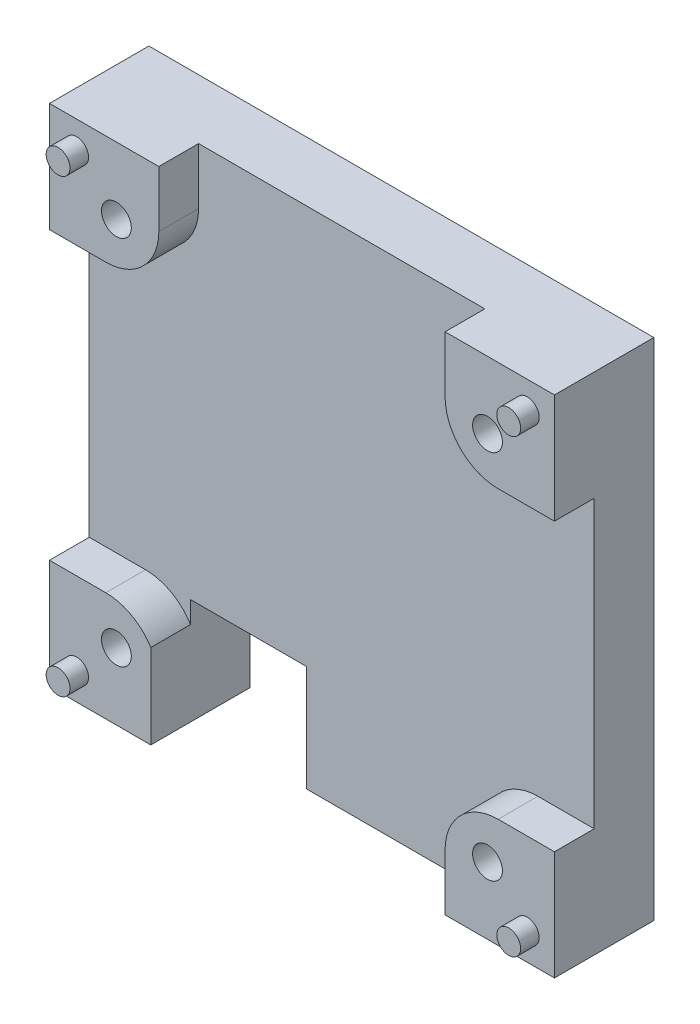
ISO-10303-21;
HEADER;
FILE_DESCRIPTION(('STEP AP214'),'2;1');
FILE_NAME('part.step','',(''),(''),'','','');
FILE_SCHEMA(('AUTOMOTIVE_DESIGN { 1 0 10303 214 1 1 1 1 }'));
ENDSEC;
DATA;
#1=APPLICATION_CONTEXT('core data for automotive mechanical design processes');
#2=APPLICATION_PROTOCOL_DEFINITION('international standard','automotive_design',2000,#1);
#3=PRODUCT_CONTEXT('',#1,'mechanical');
#4=PRODUCT('Part','Part','',(#3));
#5=PRODUCT_RELATED_PRODUCT_CATEGORY('part','',(#4));
#6=PRODUCT_DEFINITION_FORMATION('','',#4);
#7=PRODUCT_DEFINITION_CONTEXT('part definition',#1,'design');
#8=PRODUCT_DEFINITION('design','',#6,#7);
#9=PRODUCT_DEFINITION_SHAPE('','',#8);
#10=(LENGTH_UNIT() NAMED_UNIT(*) SI_UNIT(.MILLI.,.METRE.));
#11=(NAMED_UNIT(*) PLANE_ANGLE_UNIT() SI_UNIT($,.RADIAN.));
#12=(NAMED_UNIT(*) SI_UNIT($,.STERADIAN.) SOLID_ANGLE_UNIT());
#13=UNCERTAINTY_MEASURE_WITH_UNIT(LENGTH_MEASURE(1.E-05),#10,'distance_accuracy_value','');
#14=(GEOMETRIC_REPRESENTATION_CONTEXT(3) GLOBAL_UNCERTAINTY_ASSIGNED_CONTEXT((#13)) GLOBAL_UNIT_ASSIGNED_CONTEXT((#10,
#11,#12)) REPRESENTATION_CONTEXT('',''));
#15=CARTESIAN_POINT('',(0.,0.,0.));
#16=DIRECTION('',(0.,0.,1.));
#17=DIRECTION('',(1.,0.,0.));
#18=AXIS2_PLACEMENT_3D('',#15,#16,#17);
#19=CARTESIAN_POINT('',(-18.5836519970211,-7.48549408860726,-4.5));
#20=DIRECTION('',(0.,-1.,0.));
#21=DIRECTION('',(0.,0.,-1.));
#22=AXIS2_PLACEMENT_3D('',#19,#20,#21);
#23=PLANE('',#22);
#24=DIRECTION('',(0.,0.,-1.));
#25=VECTOR('',#24,1.);
#26=CARTESIAN_POINT('',(-10.9386519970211,-7.48549408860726,5.5));
#27=LINE('',#26,#25);
#28=CARTESIAN_POINT('',(-10.9386519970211,-7.48549408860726,3.));
#29=VERTEX_POINT('',#28);
#30=CARTESIAN_POINT('',(-10.9386519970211,-7.48549408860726,-4.5));
#31=VERTEX_POINT('',#30);
#32=EDGE_CURVE('E206',#29,#31,#27,.T.);
#33=ORIENTED_EDGE('',*,*,#32,.F.);
#34=DIRECTION('',(1.,0.,0.));
#35=VECTOR('',#34,1.);
#36=CARTESIAN_POINT('',(-18.5836519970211,-7.48549408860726,3.));
#37=LINE('',#36,#35);
#38=CARTESIAN_POINT('',(-18.5836519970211,-7.48549408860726,3.));
#39=VERTEX_POINT('',#38);
#40=EDGE_CURVE('E427',#39,#29,#37,.T.);
#41=ORIENTED_EDGE('',*,*,#40,.F.);
#42=DIRECTION('',(0.,0.,1.));
#43=VECTOR('',#42,1.);
#44=CARTESIAN_POINT('',(-18.5836519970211,-7.48549408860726,-4.5));
#45=LINE('',#44,#43);
#46=CARTESIAN_POINT('',(-18.5836519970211,-7.48549408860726,-4.5));
#47=VERTEX_POINT('',#46);
#48=EDGE_CURVE('E234',#47,#39,#45,.T.);
#49=ORIENTED_EDGE('',*,*,#48,.F.);
#50=DIRECTION('',(1.,0.,0.));
#51=VECTOR('',#50,1.);
#52=CARTESIAN_POINT('',(-18.5836519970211,-7.48549408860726,-4.5));
#53=LINE('',#52,#51);
#54=EDGE_CURVE('E221',#47,#31,#53,.T.);
#55=ORIENTED_EDGE('',*,*,#54,.T.);
#56=EDGE_LOOP('',(#33,#41,#49,#55));
#57=FACE_BOUND('',#56,.T.);
#58=ADVANCED_FACE('F37',(#57),#23,.T.);
#59=CARTESIAN_POINT('',(0.,0.,0.));
#60=DIRECTION('',(0.,0.,1.));
#61=DIRECTION('',(1.,0.,0.));
#62=AXIS2_PLACEMENT_3D('',#59,#60,#61);
#63=PLANE('',#62);
#64=DIRECTION('',(0.,1.,0.));
#65=VECTOR('',#64,1.);
#66=CARTESIAN_POINT('',(-2.18865199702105,0.,0.));
#67=LINE('',#66,#65);
#68=CARTESIAN_POINT('',(-2.18865199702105,-7.48549408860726,0.));
#69=VERTEX_POINT('',#68);
#70=CARTESIAN_POINT('',(-2.18865199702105,0.514505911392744,0.));
#71=VERTEX_POINT('',#70);
#72=EDGE_CURVE('E420',#69,#71,#67,.T.);
#73=ORIENTED_EDGE('',*,*,#72,.F.);
#74=DIRECTION('',(1.,0.,0.));
#75=VECTOR('',#74,1.);
#76=CARTESIAN_POINT('',(-18.5836519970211,-7.48549408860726,0.));
#77=LINE('',#76,#75);
#78=CARTESIAN_POINT('',(11.2663480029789,-7.48549408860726,0.));
#79=VERTEX_POINT('',#78);
#80=EDGE_CURVE('E213',#69,#79,#77,.T.);
#81=ORIENTED_EDGE('',*,*,#80,.T.);
#82=DIRECTION('',(0.,-1.,0.));
#83=VECTOR('',#82,1.);
#84=CARTESIAN_POINT('',(11.2663480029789,-7.48549408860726,0.));
#85=LINE('',#84,#83);
#86=CARTESIAN_POINT('',(11.2663480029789,-3.23549408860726,0.));
#87=VERTEX_POINT('',#86);
#88=EDGE_CURVE('E445',#87,#79,#85,.T.);
#89=ORIENTED_EDGE('',*,*,#88,.F.);
#90=CARTESIAN_POINT('',(15.2663480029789,-3.23549408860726,0.));
#91=DIRECTION('',(0.,0.,1.));
#92=DIRECTION('',(1.,0.,0.));
#93=AXIS2_PLACEMENT_3D('',#90,#91,#92);
#94=CIRCLE('',#93,4.);
#95=CARTESIAN_POINT('',(15.2663480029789,0.764505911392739,0.));
#96=VERTEX_POINT('',#95);
#97=EDGE_CURVE('E448',#96,#87,#94,.T.);
#98=ORIENTED_EDGE('',*,*,#97,.F.);
#99=DIRECTION('',(-1.,0.,0.));
#100=VECTOR('',#99,1.);
#101=CARTESIAN_POINT('',(19.516348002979,0.764505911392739,0.));
#102=LINE('',#101,#100);
#103=CARTESIAN_POINT('',(19.5163480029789,0.764505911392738,0.));
#104=VERTEX_POINT('',#103);
#105=EDGE_CURVE('E452',#104,#96,#102,.T.);
#106=ORIENTED_EDGE('',*,*,#105,.F.);
#107=DIRECTION('',(0.,1.,0.));
#108=VECTOR('',#107,1.);
#109=CARTESIAN_POINT('',(19.5163480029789,30.6145059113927,0.));
#110=LINE('',#109,#108);
#111=CARTESIAN_POINT('',(19.5163480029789,22.3645059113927,0.));
#112=VERTEX_POINT('',#111);
#113=EDGE_CURVE('E239',#104,#112,#110,.T.);
#114=ORIENTED_EDGE('',*,*,#113,.T.);
#115=DIRECTION('',(1.,0.,0.));
#116=VECTOR('',#115,1.);
#117=CARTESIAN_POINT('',(19.5163480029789,22.3645059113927,0.));
#118=LINE('',#117,#116);
#119=CARTESIAN_POINT('',(15.2663480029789,22.3645059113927,0.));
#120=VERTEX_POINT('',#119);
#121=EDGE_CURVE('E479',#120,#112,#118,.T.);
#122=ORIENTED_EDGE('',*,*,#121,.F.);
#123=CARTESIAN_POINT('',(15.2663480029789,26.3645059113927,0.));
#124=DIRECTION('',(0.,0.,1.));
#125=DIRECTION('',(-1.,0.,0.));
#126=AXIS2_PLACEMENT_3D('',#123,#124,#125);
#127=CIRCLE('',#126,4.);
#128=CARTESIAN_POINT('',(11.2663480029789,26.3645059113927,0.));
#129=VERTEX_POINT('',#128);
#130=EDGE_CURVE('E275',#129,#120,#127,.T.);
#131=ORIENTED_EDGE('',*,*,#130,.F.);
#132=DIRECTION('',(0.,-1.,0.));
#133=VECTOR('',#132,1.);
#134=CARTESIAN_POINT('',(11.2663480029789,30.6145059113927,0.));
#135=LINE('',#134,#133);
#136=CARTESIAN_POINT('',(11.2663480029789,30.6145059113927,0.));
#137=VERTEX_POINT('',#136);
#138=EDGE_CURVE('E270',#137,#129,#135,.T.);
#139=ORIENTED_EDGE('',*,*,#138,.F.);
#140=DIRECTION('',(-1.,0.,0.));
#141=VECTOR('',#140,1.);
#142=CARTESIAN_POINT('',(-18.5836519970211,30.6145059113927,0.));
#143=LINE('',#142,#141);
#144=CARTESIAN_POINT('',(-10.3336519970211,30.6145059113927,0.));
#145=VERTEX_POINT('',#144);
#146=EDGE_CURVE('E226',#137,#145,#143,.T.);
#147=ORIENTED_EDGE('',*,*,#146,.T.);
#148=DIRECTION('',(0.,1.,0.));
#149=VECTOR('',#148,1.);
#150=CARTESIAN_POINT('',(-10.3336519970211,30.6145059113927,0.));
#151=LINE('',#150,#149);
#152=CARTESIAN_POINT('',(-10.3336519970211,26.3645059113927,0.));
#153=VERTEX_POINT('',#152);
#154=EDGE_CURVE('E284',#153,#145,#151,.T.);
#155=ORIENTED_EDGE('',*,*,#154,.F.);
#156=CARTESIAN_POINT('',(-14.3336519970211,26.3645059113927,0.));
#157=DIRECTION('',(0.,0.,1.));
#158=DIRECTION('',(1.,0.,0.));
#159=AXIS2_PLACEMENT_3D('',#156,#157,#158);
#160=CIRCLE('',#159,4.);
#161=CARTESIAN_POINT('',(-14.3336519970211,22.3645059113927,0.));
#162=VERTEX_POINT('',#161);
#163=EDGE_CURVE('E296',#162,#153,#160,.T.);
#164=ORIENTED_EDGE('',*,*,#163,.F.);
#165=DIRECTION('',(1.,0.,0.));
#166=VECTOR('',#165,1.);
#167=CARTESIAN_POINT('',(-18.5836519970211,22.3645059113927,0.));
#168=LINE('',#167,#166);
#169=CARTESIAN_POINT('',(-18.5836519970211,22.3645059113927,0.));
#170=VERTEX_POINT('',#169);
#171=EDGE_CURVE('E273',#170,#162,#168,.T.);
#172=ORIENTED_EDGE('',*,*,#171,.F.);
#173=DIRECTION('',(0.,-1.,0.));
#174=VECTOR('',#173,1.);
#175=CARTESIAN_POINT('',(-18.5836519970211,30.6145059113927,0.));
#176=LINE('',#175,#174);
#177=CARTESIAN_POINT('',(-18.5836519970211,0.764505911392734,0.));
#178=VERTEX_POINT('',#177);
#179=EDGE_CURVE('E235',#170,#178,#176,.T.);
#180=ORIENTED_EDGE('',*,*,#179,.T.);
#181=DIRECTION('',(-1.,0.,0.));
#182=VECTOR('',#181,1.);
#183=CARTESIAN_POINT('',(-18.5836519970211,0.764505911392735,0.));
#184=LINE('',#183,#182);
#185=CARTESIAN_POINT('',(-14.3336519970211,0.764505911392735,0.));
#186=VERTEX_POINT('',#185);
#187=EDGE_CURVE('E404',#186,#178,#184,.T.);
#188=ORIENTED_EDGE('',*,*,#187,.F.);
#189=CARTESIAN_POINT('',(-14.3336519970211,-3.23549408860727,0.));
#190=DIRECTION('',(0.,0.,1.));
#191=DIRECTION('',(-1.,0.,0.));
#192=AXIS2_PLACEMENT_3D('',#189,#190,#191);
#193=CIRCLE('',#192,4.);
#194=CARTESIAN_POINT('',(-10.9386519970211,-1.12031679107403,0.));
#195=VERTEX_POINT('',#194);
#196=EDGE_CURVE('E59',#195,#186,#193,.T.);
#197=ORIENTED_EDGE('',*,*,#196,.F.);
#198=DIRECTION('',(0.,-1.,0.));
#199=VECTOR('',#198,1.);
#200=CARTESIAN_POINT('',(-10.9386519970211,0.,0.));
#201=LINE('',#200,#199);
#202=CARTESIAN_POINT('',(-10.9386519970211,0.514505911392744,0.));
#203=VERTEX_POINT('',#202);
#204=EDGE_CURVE('E52',#203,#195,#201,.T.);
#205=ORIENTED_EDGE('',*,*,#204,.F.);
#206=DIRECTION('',(-1.,0.,0.));
#207=VECTOR('',#206,1.);
#208=CARTESIAN_POINT('',(0.,0.514505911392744,0.));
#209=LINE('',#208,#207);
#210=EDGE_CURVE('E915',#71,#203,#209,.T.);
#211=ORIENTED_EDGE('',*,*,#210,.F.);
#212=EDGE_LOOP('',(#73,#81,#89,#98,#106,#114,#122,#131,#139,#147,#155,#164,#172,#180,#188,#197,
#205,#211));
#213=FACE_BOUND('',#212,.T.);
#214=ADVANCED_FACE('F351',(#213),#63,.T.);
#215=CARTESIAN_POINT('',(-18.5836519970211,30.6145059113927,-4.5));
#216=DIRECTION('',(-1.,0.,0.));
#217=DIRECTION('',(0.,0.,1.));
#218=AXIS2_PLACEMENT_3D('',#215,#216,#217);
#219=PLANE('',#218);
#220=ORIENTED_EDGE('',*,*,#179,.F.);
#221=DIRECTION('',(0.,0.,-1.));
#222=VECTOR('',#221,1.);
#223=CARTESIAN_POINT('',(-18.5836519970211,22.3645059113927,3.));
#224=LINE('',#223,#222);
#225=CARTESIAN_POINT('',(-18.5836519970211,22.3645059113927,3.));
#226=VERTEX_POINT('',#225);
#227=EDGE_CURVE('E309',#226,#170,#224,.T.);
#228=ORIENTED_EDGE('',*,*,#227,.F.);
#229=DIRECTION('',(0.,-1.,0.));
#230=VECTOR('',#229,1.);
#231=CARTESIAN_POINT('',(-18.5836519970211,30.6145059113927,3.));
#232=LINE('',#231,#230);
#233=CARTESIAN_POINT('',(-18.5836519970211,30.6145059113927,3.));
#234=VERTEX_POINT('',#233);
#235=EDGE_CURVE('E280',#234,#226,#232,.T.);
#236=ORIENTED_EDGE('',*,*,#235,.F.);
#237=DIRECTION('',(0.,0.,1.));
#238=VECTOR('',#237,1.);
#239=CARTESIAN_POINT('',(-18.5836519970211,30.6145059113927,-4.5));
#240=LINE('',#239,#238);
#241=CARTESIAN_POINT('',(-18.5836519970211,30.6145059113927,-4.5));
#242=VERTEX_POINT('',#241);
#243=EDGE_CURVE('E242',#242,#234,#240,.T.);
#244=ORIENTED_EDGE('',*,*,#243,.F.);
#245=DIRECTION('',(0.,-1.,0.));
#246=VECTOR('',#245,1.);
#247=CARTESIAN_POINT('',(-18.5836519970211,30.6145059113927,-4.5));
#248=LINE('',#247,#246);
#249=EDGE_CURVE('E222',#242,#47,#248,.T.);
#250=ORIENTED_EDGE('',*,*,#249,.T.);
#251=ORIENTED_EDGE('',*,*,#48,.T.);
#252=DIRECTION('',(0.,-1.,0.));
#253=VECTOR('',#252,1.);
#254=CARTESIAN_POINT('',(-18.5836519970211,-7.48549408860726,3.));
#255=LINE('',#254,#253);
#256=CARTESIAN_POINT('',(-18.5836519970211,0.764505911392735,3.));
#257=VERTEX_POINT('',#256);
#258=EDGE_CURVE('E413',#257,#39,#255,.T.);
#259=ORIENTED_EDGE('',*,*,#258,.F.);
#260=DIRECTION('',(0.,0.,-1.));
#261=VECTOR('',#260,1.);
#262=CARTESIAN_POINT('',(-18.5836519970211,0.764505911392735,3.));
#263=LINE('',#262,#261);
#264=EDGE_CURVE('E410',#257,#178,#263,.T.);
#265=ORIENTED_EDGE('',*,*,#264,.T.);
#266=EDGE_LOOP('',(#220,#228,#236,#244,#250,#251,#259,#265));
#267=FACE_BOUND('',#266,.T.);
#268=ADVANCED_FACE('F39',(#267),#219,.T.);
#269=CARTESIAN_POINT('',(-18.5836519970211,30.6145059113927,-4.5));
#270=DIRECTION('',(0.,1.,0.));
#271=DIRECTION('',(0.,0.,1.));
#272=AXIS2_PLACEMENT_3D('',#269,#270,#271);
#273=PLANE('',#272);
#274=ORIENTED_EDGE('',*,*,#146,.F.);
#275=DIRECTION('',(0.,0.,-1.));
#276=VECTOR('',#275,1.);
#277=CARTESIAN_POINT('',(11.2663480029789,30.6145059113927,3.));
#278=LINE('',#277,#276);
#279=CARTESIAN_POINT('',(11.2663480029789,30.6145059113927,3.));
#280=VERTEX_POINT('',#279);
#281=EDGE_CURVE('E468',#280,#137,#278,.T.);
#282=ORIENTED_EDGE('',*,*,#281,.F.);
#283=DIRECTION('',(-1.,0.,0.));
#284=VECTOR('',#283,1.);
#285=CARTESIAN_POINT('',(19.5163480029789,30.6145059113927,3.));
#286=LINE('',#285,#284);
#287=CARTESIAN_POINT('',(19.5163480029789,30.6145059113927,3.));
#288=VERTEX_POINT('',#287);
#289=EDGE_CURVE('E488',#288,#280,#286,.T.);
#290=ORIENTED_EDGE('',*,*,#289,.F.);
#291=DIRECTION('',(0.,0.,1.));
#292=VECTOR('',#291,1.);
#293=CARTESIAN_POINT('',(19.5163480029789,30.6145059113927,-4.5));
#294=LINE('',#293,#292);
#295=CARTESIAN_POINT('',(19.5163480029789,30.6145059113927,-4.5));
#296=VERTEX_POINT('',#295);
#297=EDGE_CURVE('E245',#296,#288,#294,.T.);
#298=ORIENTED_EDGE('',*,*,#297,.F.);
#299=DIRECTION('',(-1.,0.,0.));
#300=VECTOR('',#299,1.);
#301=CARTESIAN_POINT('',(-18.5836519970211,30.6145059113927,-4.5));
#302=LINE('',#301,#300);
#303=EDGE_CURVE('E231',#296,#242,#302,.T.);
#304=ORIENTED_EDGE('',*,*,#303,.T.);
#305=ORIENTED_EDGE('',*,*,#243,.T.);
#306=DIRECTION('',(-1.,0.,0.));
#307=VECTOR('',#306,1.);
#308=CARTESIAN_POINT('',(-18.5836519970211,30.6145059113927,3.));
#309=LINE('',#308,#307);
#310=CARTESIAN_POINT('',(-10.3336519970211,30.6145059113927,3.));
#311=VERTEX_POINT('',#310);
#312=EDGE_CURVE('E290',#311,#234,#309,.T.);
#313=ORIENTED_EDGE('',*,*,#312,.F.);
#314=DIRECTION('',(0.,0.,-1.));
#315=VECTOR('',#314,1.);
#316=CARTESIAN_POINT('',(-10.3336519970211,30.6145059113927,3.));
#317=LINE('',#316,#315);
#318=EDGE_CURVE('E293',#311,#145,#317,.T.);
#319=ORIENTED_EDGE('',*,*,#318,.T.);
#320=EDGE_LOOP('',(#274,#282,#290,#298,#304,#305,#313,#319));
#321=FACE_BOUND('',#320,.T.);
#322=ADVANCED_FACE('F368',(#321),#273,.T.);
#323=CARTESIAN_POINT('',(19.5163480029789,30.6145059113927,-4.5));
#324=DIRECTION('',(1.,0.,0.));
#325=DIRECTION('',(0.,0.,-1.));
#326=AXIS2_PLACEMENT_3D('',#323,#324,#325);
#327=PLANE('',#326);
#328=ORIENTED_EDGE('',*,*,#113,.F.);
#329=DIRECTION('',(0.,0.,-1.));
#330=VECTOR('',#329,1.);
#331=CARTESIAN_POINT('',(19.516348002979,0.764505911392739,3.));
#332=LINE('',#331,#330);
#333=CARTESIAN_POINT('',(19.516348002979,0.764505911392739,3.));
#334=VERTEX_POINT('',#333);
#335=EDGE_CURVE('E433',#334,#104,#332,.T.);
#336=ORIENTED_EDGE('',*,*,#335,.F.);
#337=DIRECTION('',(0.,1.,0.));
#338=VECTOR('',#337,1.);
#339=CARTESIAN_POINT('',(19.5163480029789,-7.48549408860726,3.));
#340=LINE('',#339,#338);
#341=CARTESIAN_POINT('',(19.5163480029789,-7.48549408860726,3.));
#342=VERTEX_POINT('',#341);
#343=EDGE_CURVE('E449',#342,#334,#340,.T.);
#344=ORIENTED_EDGE('',*,*,#343,.F.);
#345=DIRECTION('',(0.,0.,1.));
#346=VECTOR('',#345,1.);
#347=CARTESIAN_POINT('',(19.5163480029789,-7.48549408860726,-4.5));
#348=LINE('',#347,#346);
#349=CARTESIAN_POINT('',(19.5163480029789,-7.48549408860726,-4.5));
#350=VERTEX_POINT('',#349);
#351=EDGE_CURVE('E247',#350,#342,#348,.T.);
#352=ORIENTED_EDGE('',*,*,#351,.F.);
#353=DIRECTION('',(0.,1.,0.));
#354=VECTOR('',#353,1.);
#355=CARTESIAN_POINT('',(19.5163480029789,30.6145059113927,-4.5));
#356=LINE('',#355,#354);
#357=EDGE_CURVE('E220',#350,#296,#356,.T.);
#358=ORIENTED_EDGE('',*,*,#357,.T.);
#359=ORIENTED_EDGE('',*,*,#297,.T.);
#360=DIRECTION('',(0.,1.,0.));
#361=VECTOR('',#360,1.);
#362=CARTESIAN_POINT('',(19.5163480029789,30.6145059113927,3.));
#363=LINE('',#362,#361);
#364=CARTESIAN_POINT('',(19.5163480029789,22.3645059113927,3.));
#365=VERTEX_POINT('',#364);
#366=EDGE_CURVE('E264',#365,#288,#363,.T.);
#367=ORIENTED_EDGE('',*,*,#366,.F.);
#368=DIRECTION('',(0.,0.,-1.));
#369=VECTOR('',#368,1.);
#370=CARTESIAN_POINT('',(19.5163480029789,22.3645059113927,3.));
#371=LINE('',#370,#369);
#372=EDGE_CURVE('E475',#365,#112,#371,.T.);
#373=ORIENTED_EDGE('',*,*,#372,.T.);
#374=EDGE_LOOP('',(#328,#336,#344,#352,#358,#359,#367,#373));
#375=FACE_BOUND('',#374,.T.);
#376=ADVANCED_FACE('F361',(#375),#327,.T.);
#377=DIRECTION('',(0.,0.,-1.));
#378=VECTOR('',#377,1.);
#379=CARTESIAN_POINT('',(-2.18865199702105,-7.48549408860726,5.5));
#380=LINE('',#379,#378);
#381=CARTESIAN_POINT('',(-2.18865199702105,-7.48549408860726,-4.5));
#382=VERTEX_POINT('',#381);
#383=EDGE_CURVE('E197',#69,#382,#380,.T.);
#384=ORIENTED_EDGE('',*,*,#383,.T.);
#385=EDGE_CURVE('E210',#382,#350,#53,.T.);
#386=ORIENTED_EDGE('',*,*,#385,.T.);
#387=ORIENTED_EDGE('',*,*,#351,.T.);
#388=DIRECTION('',(1.,0.,0.));
#389=VECTOR('',#388,1.);
#390=CARTESIAN_POINT('',(19.5163480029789,-7.48549408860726,3.));
#391=LINE('',#390,#389);
#392=CARTESIAN_POINT('',(11.2663480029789,-7.48549408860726,3.));
#393=VERTEX_POINT('',#392);
#394=EDGE_CURVE('E444',#393,#342,#391,.T.);
#395=ORIENTED_EDGE('',*,*,#394,.F.);
#396=DIRECTION('',(0.,0.,-1.));
#397=VECTOR('',#396,1.);
#398=CARTESIAN_POINT('',(11.2663480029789,-7.48549408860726,3.));
#399=LINE('',#398,#397);
#400=EDGE_CURVE('E442',#393,#79,#399,.T.);
#401=ORIENTED_EDGE('',*,*,#400,.T.);
#402=ORIENTED_EDGE('',*,*,#80,.F.);
#403=EDGE_LOOP('',(#384,#386,#387,#395,#401,#402));
#404=FACE_BOUND('',#403,.T.);
#405=ADVANCED_FACE('F209',(#404),#23,.T.);
#406=CARTESIAN_POINT('',(0.,0.,-4.5));
#407=DIRECTION('',(0.,0.,1.));
#408=DIRECTION('',(1.,0.,0.));
#409=AXIS2_PLACEMENT_3D('',#406,#407,#408);
#410=PLANE('',#409);
#411=CARTESIAN_POINT('',(-13.5336519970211,-2.43549408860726,-4.5));
#412=DIRECTION('',(0.,0.,1.));
#413=DIRECTION('',(1.,0.,0.));
#414=AXIS2_PLACEMENT_3D('',#411,#412,#413);
#415=CIRCLE('',#414,1.125);
#416=CARTESIAN_POINT('',(-12.4086519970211,-2.43549408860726,-4.5));
#417=VERTEX_POINT('',#416);
#418=EDGE_CURVE('E312',#417,#417,#415,.T.);
#419=ORIENTED_EDGE('',*,*,#418,.T.);
#420=EDGE_LOOP('',(#419));
#421=FACE_BOUND('',#420,.T.);
#422=CARTESIAN_POINT('',(14.4663480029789,-2.43549408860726,-4.5));
#423=DIRECTION('',(0.,0.,1.));
#424=DIRECTION('',(1.,0.,0.));
#425=AXIS2_PLACEMENT_3D('',#422,#423,#424);
#426=CIRCLE('',#425,1.125);
#427=CARTESIAN_POINT('',(15.5913480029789,-2.43549408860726,-4.5));
#428=VERTEX_POINT('',#427);
#429=EDGE_CURVE('E315',#428,#428,#426,.T.);
#430=ORIENTED_EDGE('',*,*,#429,.T.);
#431=EDGE_LOOP('',(#430));
#432=FACE_BOUND('',#431,.T.);
#433=CARTESIAN_POINT('',(14.4663480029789,25.5645059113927,-4.5));
#434=DIRECTION('',(0.,0.,1.));
#435=DIRECTION('',(1.,0.,0.));
#436=AXIS2_PLACEMENT_3D('',#433,#434,#435);
#437=CIRCLE('',#436,1.125);
#438=CARTESIAN_POINT('',(15.5913480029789,25.5645059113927,-4.5));
#439=VERTEX_POINT('',#438);
#440=EDGE_CURVE('E318',#439,#439,#437,.T.);
#441=ORIENTED_EDGE('',*,*,#440,.T.);
#442=EDGE_LOOP('',(#441));
#443=FACE_BOUND('',#442,.T.);
#444=CARTESIAN_POINT('',(-13.5336519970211,25.5645059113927,-4.5));
#445=DIRECTION('',(0.,0.,1.));
#446=DIRECTION('',(1.,0.,0.));
#447=AXIS2_PLACEMENT_3D('',#444,#445,#446);
#448=CIRCLE('',#447,1.125);
#449=CARTESIAN_POINT('',(-12.4086519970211,25.5645059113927,-4.5));
#450=VERTEX_POINT('',#449);
#451=EDGE_CURVE('E237',#450,#450,#448,.T.);
#452=ORIENTED_EDGE('',*,*,#451,.T.);
#453=EDGE_LOOP('',(#452));
#454=FACE_BOUND('',#453,.T.);
#455=DIRECTION('',(0.,1.,0.));
#456=VECTOR('',#455,1.);
#457=CARTESIAN_POINT('',(-10.9386519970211,0.514505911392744,-4.5));
#458=LINE('',#457,#456);
#459=CARTESIAN_POINT('',(-10.9386519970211,0.514505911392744,-4.5));
#460=VERTEX_POINT('',#459);
#461=EDGE_CURVE('E205',#31,#460,#458,.T.);
#462=ORIENTED_EDGE('',*,*,#461,.F.);
#463=ORIENTED_EDGE('',*,*,#54,.F.);
#464=ORIENTED_EDGE('',*,*,#249,.F.);
#465=ORIENTED_EDGE('',*,*,#303,.F.);
#466=ORIENTED_EDGE('',*,*,#357,.F.);
#467=ORIENTED_EDGE('',*,*,#385,.F.);
#468=DIRECTION('',(0.,-1.,0.));
#469=VECTOR('',#468,1.);
#470=CARTESIAN_POINT('',(-2.18865199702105,0.514505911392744,-4.5));
#471=LINE('',#470,#469);
#472=CARTESIAN_POINT('',(-2.18865199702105,0.514505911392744,-4.5));
#473=VERTEX_POINT('',#472);
#474=EDGE_CURVE('E194',#473,#382,#471,.T.);
#475=ORIENTED_EDGE('',*,*,#474,.F.);
#476=DIRECTION('',(1.,0.,0.));
#477=VECTOR('',#476,1.);
#478=CARTESIAN_POINT('',(-2.18865199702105,0.514505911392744,-4.5));
#479=LINE('',#478,#477);
#480=EDGE_CURVE('E919',#460,#473,#479,.T.);
#481=ORIENTED_EDGE('',*,*,#480,.F.);
#482=EDGE_LOOP('',(#462,#463,#464,#465,#466,#467,#475,#481));
#483=FACE_BOUND('',#482,.T.);
#484=ADVANCED_FACE('F217',(#421,#432,#443,#454,#483),#410,.F.);
#485=CARTESIAN_POINT('',(-13.5336519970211,25.5645059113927,-4.5));
#486=DIRECTION('',(0.,0.,1.));
#487=DIRECTION('',(1.,0.,0.));
#488=AXIS2_PLACEMENT_3D('',#485,#486,#487);
#489=CYLINDRICAL_SURFACE('',#488,1.125);
#490=ORIENTED_EDGE('',*,*,#451,.F.);
#491=EDGE_LOOP('',(#490));
#492=FACE_BOUND('',#491,.T.);
#493=CARTESIAN_POINT('',(-13.5336519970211,25.5645059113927,3.));
#494=DIRECTION('',(0.,0.,1.));
#495=DIRECTION('',(1.,0.,0.));
#496=AXIS2_PLACEMENT_3D('',#493,#494,#495);
#497=CIRCLE('',#496,1.125);
#498=CARTESIAN_POINT('',(-12.4086519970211,25.5645059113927,3.));
#499=VERTEX_POINT('',#498);
#500=EDGE_CURVE('E269',#499,#499,#497,.T.);
#501=ORIENTED_EDGE('',*,*,#500,.T.);
#502=EDGE_LOOP('',(#501));
#503=FACE_BOUND('',#502,.T.);
#504=ADVANCED_FACE('F324',(#492,#503),#489,.F.);
#505=CARTESIAN_POINT('',(14.4663480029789,25.5645059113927,-4.5));
#506=DIRECTION('',(0.,0.,1.));
#507=DIRECTION('',(1.,0.,0.));
#508=AXIS2_PLACEMENT_3D('',#505,#506,#507);
#509=CYLINDRICAL_SURFACE('',#508,1.125);
#510=ORIENTED_EDGE('',*,*,#440,.F.);
#511=EDGE_LOOP('',(#510));
#512=FACE_BOUND('',#511,.T.);
#513=CARTESIAN_POINT('',(14.4663480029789,25.5645059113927,3.));
#514=DIRECTION('',(0.,0.,1.));
#515=DIRECTION('',(1.,0.,0.));
#516=AXIS2_PLACEMENT_3D('',#513,#514,#515);
#517=CIRCLE('',#516,1.125);
#518=CARTESIAN_POINT('',(15.5913480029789,25.5645059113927,3.));
#519=VERTEX_POINT('',#518);
#520=EDGE_CURVE('E267',#519,#519,#517,.T.);
#521=ORIENTED_EDGE('',*,*,#520,.T.);
#522=EDGE_LOOP('',(#521));
#523=FACE_BOUND('',#522,.T.);
#524=ADVANCED_FACE('F327',(#512,#523),#509,.F.);
#525=CARTESIAN_POINT('',(14.4663480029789,-2.43549408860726,-4.5));
#526=DIRECTION('',(0.,0.,1.));
#527=DIRECTION('',(1.,0.,0.));
#528=AXIS2_PLACEMENT_3D('',#525,#526,#527);
#529=CYLINDRICAL_SURFACE('',#528,1.125);
#530=ORIENTED_EDGE('',*,*,#429,.F.);
#531=EDGE_LOOP('',(#530));
#532=FACE_BOUND('',#531,.T.);
#533=CARTESIAN_POINT('',(14.4663480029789,-2.43549408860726,3.));
#534=DIRECTION('',(0.,0.,1.));
#535=DIRECTION('',(1.,0.,0.));
#536=AXIS2_PLACEMENT_3D('',#533,#534,#535);
#537=CIRCLE('',#536,1.125);
#538=CARTESIAN_POINT('',(15.5913480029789,-2.43549408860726,3.));
#539=VERTEX_POINT('',#538);
#540=EDGE_CURVE('E455',#539,#539,#537,.T.);
#541=ORIENTED_EDGE('',*,*,#540,.T.);
#542=EDGE_LOOP('',(#541));
#543=FACE_BOUND('',#542,.T.);
#544=ADVANCED_FACE('F344',(#532,#543),#529,.F.);
#545=CARTESIAN_POINT('',(-13.5336519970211,-2.43549408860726,-4.5));
#546=DIRECTION('',(0.,0.,1.));
#547=DIRECTION('',(1.,0.,0.));
#548=AXIS2_PLACEMENT_3D('',#545,#546,#547);
#549=CYLINDRICAL_SURFACE('',#548,1.125);
#550=ORIENTED_EDGE('',*,*,#418,.F.);
#551=EDGE_LOOP('',(#550));
#552=FACE_BOUND('',#551,.T.);
#553=CARTESIAN_POINT('',(-13.5336519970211,-2.43549408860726,3.));
#554=DIRECTION('',(0.,0.,1.));
#555=DIRECTION('',(1.,0.,0.));
#556=AXIS2_PLACEMENT_3D('',#553,#554,#555);
#557=CIRCLE('',#556,1.125);
#558=CARTESIAN_POINT('',(-12.4086519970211,-2.43549408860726,3.));
#559=VERTEX_POINT('',#558);
#560=EDGE_CURVE('E424',#559,#559,#557,.T.);
#561=ORIENTED_EDGE('',*,*,#560,.T.);
#562=EDGE_LOOP('',(#561));
#563=FACE_BOUND('',#562,.T.);
#564=ADVANCED_FACE('F334',(#552,#563),#549,.F.);
#565=CARTESIAN_POINT('',(-14.3336519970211,26.3645059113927,3.));
#566=DIRECTION('',(0.,0.,1.));
#567=DIRECTION('',(1.,0.,0.));
#568=AXIS2_PLACEMENT_3D('',#565,#566,#567);
#569=PLANE('',#568);
#570=CARTESIAN_POINT('',(-16.5336519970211,28.5645059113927,3.));
#571=DIRECTION('',(0.,0.,1.));
#572=DIRECTION('',(1.,0.,0.));
#573=AXIS2_PLACEMENT_3D('',#570,#571,#572);
#574=CIRCLE('',#573,0.900000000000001);
#575=CARTESIAN_POINT('',(-15.6336519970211,28.5645059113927,3.));
#576=VERTEX_POINT('',#575);
#577=EDGE_CURVE('E940',#576,#576,#574,.T.);
#578=ORIENTED_EDGE('',*,*,#577,.F.);
#579=EDGE_LOOP('',(#578));
#580=FACE_BOUND('',#579,.T.);
#581=ORIENTED_EDGE('',*,*,#235,.T.);
#582=DIRECTION('',(1.,0.,0.));
#583=VECTOR('',#582,1.);
#584=CARTESIAN_POINT('',(-18.5836519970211,22.3645059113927,3.));
#585=LINE('',#584,#583);
#586=CARTESIAN_POINT('',(-14.3336519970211,22.3645059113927,3.));
#587=VERTEX_POINT('',#586);
#588=EDGE_CURVE('E283',#226,#587,#585,.T.);
#589=ORIENTED_EDGE('',*,*,#588,.T.);
#590=CARTESIAN_POINT('',(-14.3336519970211,26.3645059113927,3.));
#591=DIRECTION('',(0.,0.,1.));
#592=DIRECTION('',(1.,0.,0.));
#593=AXIS2_PLACEMENT_3D('',#590,#591,#592);
#594=CIRCLE('',#593,4.);
#595=CARTESIAN_POINT('',(-10.3336519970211,26.3645059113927,3.));
#596=VERTEX_POINT('',#595);
#597=EDGE_CURVE('E286',#587,#596,#594,.T.);
#598=ORIENTED_EDGE('',*,*,#597,.T.);
#599=DIRECTION('',(0.,1.,0.));
#600=VECTOR('',#599,1.);
#601=CARTESIAN_POINT('',(-10.3336519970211,30.6145059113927,3.));
#602=LINE('',#601,#600);
#603=EDGE_CURVE('E288',#596,#311,#602,.T.);
#604=ORIENTED_EDGE('',*,*,#603,.T.);
#605=ORIENTED_EDGE('',*,*,#312,.T.);
#606=EDGE_LOOP('',(#581,#589,#598,#604,#605));
#607=FACE_BOUND('',#606,.T.);
#608=ORIENTED_EDGE('',*,*,#500,.F.);
#609=EDGE_LOOP('',(#608));
#610=FACE_BOUND('',#609,.T.);
#611=ADVANCED_FACE('F331',(#580,#607,#610),#569,.T.);
#612=CARTESIAN_POINT('',(-18.5836519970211,22.3645059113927,3.));
#613=DIRECTION('',(0.,1.,0.));
#614=DIRECTION('',(-1.,0.,0.));
#615=AXIS2_PLACEMENT_3D('',#612,#613,#614);
#616=PLANE('',#615);
#617=ORIENTED_EDGE('',*,*,#171,.T.);
#618=DIRECTION('',(0.,0.,-1.));
#619=VECTOR('',#618,1.);
#620=CARTESIAN_POINT('',(-14.3336519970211,22.3645059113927,3.));
#621=LINE('',#620,#619);
#622=EDGE_CURVE('E306',#587,#162,#621,.T.);
#623=ORIENTED_EDGE('',*,*,#622,.F.);
#624=ORIENTED_EDGE('',*,*,#588,.F.);
#625=ORIENTED_EDGE('',*,*,#227,.T.);
#626=EDGE_LOOP('',(#617,#623,#624,#625));
#627=FACE_BOUND('',#626,.T.);
#628=ADVANCED_FACE('F333',(#627),#616,.F.);
#629=CARTESIAN_POINT('',(-14.3336519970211,26.3645059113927,3.));
#630=DIRECTION('',(0.,0.,-1.));
#631=DIRECTION('',(-1.,0.,0.));
#632=AXIS2_PLACEMENT_3D('',#629,#630,#631);
#633=CYLINDRICAL_SURFACE('',#632,4.);
#634=ORIENTED_EDGE('',*,*,#163,.T.);
#635=DIRECTION('',(0.,0.,-1.));
#636=VECTOR('',#635,1.);
#637=CARTESIAN_POINT('',(-10.3336519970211,26.3645059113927,3.));
#638=LINE('',#637,#636);
#639=EDGE_CURVE('E303',#596,#153,#638,.T.);
#640=ORIENTED_EDGE('',*,*,#639,.F.);
#641=ORIENTED_EDGE('',*,*,#597,.F.);
#642=ORIENTED_EDGE('',*,*,#622,.T.);
#643=EDGE_LOOP('',(#634,#640,#641,#642));
#644=FACE_BOUND('',#643,.T.);
#645=ADVANCED_FACE('F341',(#644),#633,.T.);
#646=CARTESIAN_POINT('',(-10.3336519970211,30.6145059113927,3.));
#647=DIRECTION('',(-1.,0.,0.));
#648=DIRECTION('',(0.,0.,1.));
#649=AXIS2_PLACEMENT_3D('',#646,#647,#648);
#650=PLANE('',#649);
#651=ORIENTED_EDGE('',*,*,#154,.T.);
#652=ORIENTED_EDGE('',*,*,#318,.F.);
#653=ORIENTED_EDGE('',*,*,#603,.F.);
#654=ORIENTED_EDGE('',*,*,#639,.T.);
#655=EDGE_LOOP('',(#651,#652,#653,#654));
#656=FACE_BOUND('',#655,.T.);
#657=ADVANCED_FACE('F259',(#656),#650,.F.);
#658=CARTESIAN_POINT('',(15.2663480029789,26.3645059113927,3.));
#659=DIRECTION('',(0.,0.,-1.));
#660=DIRECTION('',(-1.,0.,0.));
#661=AXIS2_PLACEMENT_3D('',#658,#659,#660);
#662=PLANE('',#661);
#663=CARTESIAN_POINT('',(17.466348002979,28.5645059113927,3.));
#664=DIRECTION('',(0.,0.,-1.));
#665=DIRECTION('',(-1.,0.,0.));
#666=AXIS2_PLACEMENT_3D('',#663,#664,#665);
#667=CIRCLE('',#666,0.900000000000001);
#668=CARTESIAN_POINT('',(16.5663480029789,28.5645059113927,3.));
#669=VERTEX_POINT('',#668);
#670=EDGE_CURVE('E45',#669,#669,#667,.F.);
#671=ORIENTED_EDGE('',*,*,#670,.F.);
#672=EDGE_LOOP('',(#671));
#673=FACE_BOUND('',#672,.T.);
#674=ORIENTED_EDGE('',*,*,#366,.T.);
#675=ORIENTED_EDGE('',*,*,#289,.T.);
#676=DIRECTION('',(0.,-1.,0.));
#677=VECTOR('',#676,1.);
#678=CARTESIAN_POINT('',(11.2663480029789,30.6145059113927,3.));
#679=LINE('',#678,#677);
#680=CARTESIAN_POINT('',(11.2663480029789,26.3645059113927,3.));
#681=VERTEX_POINT('',#680);
#682=EDGE_CURVE('E487',#280,#681,#679,.T.);
#683=ORIENTED_EDGE('',*,*,#682,.T.);
#684=CARTESIAN_POINT('',(15.2663480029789,26.3645059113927,3.));
#685=DIRECTION('',(0.,0.,1.));
#686=DIRECTION('',(-1.,0.,0.));
#687=AXIS2_PLACEMENT_3D('',#684,#685,#686);
#688=CIRCLE('',#687,4.);
#689=CARTESIAN_POINT('',(15.2663480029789,22.3645059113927,3.));
#690=VERTEX_POINT('',#689);
#691=EDGE_CURVE('E485',#681,#690,#688,.T.);
#692=ORIENTED_EDGE('',*,*,#691,.T.);
#693=DIRECTION('',(1.,0.,0.));
#694=VECTOR('',#693,1.);
#695=CARTESIAN_POINT('',(19.5163480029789,22.3645059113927,3.));
#696=LINE('',#695,#694);
#697=EDGE_CURVE('E478',#690,#365,#696,.T.);
#698=ORIENTED_EDGE('',*,*,#697,.T.);
#699=EDGE_LOOP('',(#674,#675,#683,#692,#698));
#700=FACE_BOUND('',#699,.T.);
#701=ORIENTED_EDGE('',*,*,#520,.F.);
#702=EDGE_LOOP('',(#701));
#703=FACE_BOUND('',#702,.T.);
#704=ADVANCED_FACE('F255',(#673,#700,#703),#662,.F.);
#705=CARTESIAN_POINT('',(11.2663480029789,30.6145059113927,3.));
#706=DIRECTION('',(1.,0.,0.));
#707=DIRECTION('',(0.,0.,-1.));
#708=AXIS2_PLACEMENT_3D('',#705,#706,#707);
#709=PLANE('',#708);
#710=ORIENTED_EDGE('',*,*,#138,.T.);
#711=DIRECTION('',(0.,0.,-1.));
#712=VECTOR('',#711,1.);
#713=CARTESIAN_POINT('',(11.2663480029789,26.3645059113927,3.));
#714=LINE('',#713,#712);
#715=EDGE_CURVE('E470',#681,#129,#714,.T.);
#716=ORIENTED_EDGE('',*,*,#715,.F.);
#717=ORIENTED_EDGE('',*,*,#682,.F.);
#718=ORIENTED_EDGE('',*,*,#281,.T.);
#719=EDGE_LOOP('',(#710,#716,#717,#718));
#720=FACE_BOUND('',#719,.T.);
#721=ADVANCED_FACE('F258',(#720),#709,.F.);
#722=CARTESIAN_POINT('',(15.2663480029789,26.3645059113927,3.));
#723=DIRECTION('',(0.,0.,-1.));
#724=DIRECTION('',(-1.,0.,0.));
#725=AXIS2_PLACEMENT_3D('',#722,#723,#724);
#726=CYLINDRICAL_SURFACE('',#725,4.);
#727=ORIENTED_EDGE('',*,*,#130,.T.);
#728=DIRECTION('',(0.,0.,-1.));
#729=VECTOR('',#728,1.);
#730=CARTESIAN_POINT('',(15.2663480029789,22.3645059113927,3.));
#731=LINE('',#730,#729);
#732=EDGE_CURVE('E473',#690,#120,#731,.T.);
#733=ORIENTED_EDGE('',*,*,#732,.F.);
#734=ORIENTED_EDGE('',*,*,#691,.F.);
#735=ORIENTED_EDGE('',*,*,#715,.T.);
#736=EDGE_LOOP('',(#727,#733,#734,#735));
#737=FACE_BOUND('',#736,.T.);
#738=ADVANCED_FACE('F498',(#737),#726,.T.);
#739=CARTESIAN_POINT('',(19.5163480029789,22.3645059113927,3.));
#740=DIRECTION('',(0.,1.,0.));
#741=DIRECTION('',(0.,0.,1.));
#742=AXIS2_PLACEMENT_3D('',#739,#740,#741);
#743=PLANE('',#742);
#744=ORIENTED_EDGE('',*,*,#121,.T.);
#745=ORIENTED_EDGE('',*,*,#372,.F.);
#746=ORIENTED_EDGE('',*,*,#697,.F.);
#747=ORIENTED_EDGE('',*,*,#732,.T.);
#748=EDGE_LOOP('',(#744,#745,#746,#747));
#749=FACE_BOUND('',#748,.T.);
#750=ADVANCED_FACE('F502',(#749),#743,.F.);
#751=CARTESIAN_POINT('',(15.2663480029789,-3.23549408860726,3.));
#752=DIRECTION('',(0.,0.,1.));
#753=DIRECTION('',(1.,0.,0.));
#754=AXIS2_PLACEMENT_3D('',#751,#752,#753);
#755=PLANE('',#754);
#756=CARTESIAN_POINT('',(17.466348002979,-5.43549408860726,3.));
#757=DIRECTION('',(0.,0.,1.));
#758=DIRECTION('',(1.,0.,0.));
#759=AXIS2_PLACEMENT_3D('',#756,#757,#758);
#760=CIRCLE('',#759,0.9);
#761=CARTESIAN_POINT('',(18.366348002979,-5.43549408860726,3.));
#762=VERTEX_POINT('',#761);
#763=EDGE_CURVE('E948',#762,#762,#760,.T.);
#764=ORIENTED_EDGE('',*,*,#763,.F.);
#765=EDGE_LOOP('',(#764));
#766=FACE_BOUND('',#765,.T.);
#767=ORIENTED_EDGE('',*,*,#343,.T.);
#768=DIRECTION('',(-1.,0.,0.));
#769=VECTOR('',#768,1.);
#770=CARTESIAN_POINT('',(19.516348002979,0.764505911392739,3.));
#771=LINE('',#770,#769);
#772=CARTESIAN_POINT('',(15.2663480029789,0.764505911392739,3.));
#773=VERTEX_POINT('',#772);
#774=EDGE_CURVE('E462',#334,#773,#771,.T.);
#775=ORIENTED_EDGE('',*,*,#774,.T.);
#776=CARTESIAN_POINT('',(15.2663480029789,-3.23549408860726,3.));
#777=DIRECTION('',(0.,0.,1.));
#778=DIRECTION('',(1.,0.,0.));
#779=AXIS2_PLACEMENT_3D('',#776,#777,#778);
#780=CIRCLE('',#779,4.);
#781=CARTESIAN_POINT('',(11.2663480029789,-3.23549408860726,3.));
#782=VERTEX_POINT('',#781);
#783=EDGE_CURVE('E460',#773,#782,#780,.T.);
#784=ORIENTED_EDGE('',*,*,#783,.T.);
#785=DIRECTION('',(0.,-1.,0.));
#786=VECTOR('',#785,1.);
#787=CARTESIAN_POINT('',(11.2663480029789,-7.48549408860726,3.));
#788=LINE('',#787,#786);
#789=EDGE_CURVE('E458',#782,#393,#788,.T.);
#790=ORIENTED_EDGE('',*,*,#789,.T.);
#791=ORIENTED_EDGE('',*,*,#394,.T.);
#792=EDGE_LOOP('',(#767,#775,#784,#790,#791));
#793=FACE_BOUND('',#792,.T.);
#794=ORIENTED_EDGE('',*,*,#540,.F.);
#795=EDGE_LOOP('',(#794));
#796=FACE_BOUND('',#795,.T.);
#797=ADVANCED_FACE('F531',(#766,#793,#796),#755,.T.);
#798=CARTESIAN_POINT('',(19.516348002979,0.764505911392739,3.));
#799=DIRECTION('',(0.,-1.,0.));
#800=DIRECTION('',(1.,0.,0.));
#801=AXIS2_PLACEMENT_3D('',#798,#799,#800);
#802=PLANE('',#801);
#803=ORIENTED_EDGE('',*,*,#105,.T.);
#804=DIRECTION('',(0.,0.,-1.));
#805=VECTOR('',#804,1.);
#806=CARTESIAN_POINT('',(15.2663480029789,0.764505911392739,3.));
#807=LINE('',#806,#805);
#808=EDGE_CURVE('E436',#773,#96,#807,.T.);
#809=ORIENTED_EDGE('',*,*,#808,.F.);
#810=ORIENTED_EDGE('',*,*,#774,.F.);
#811=ORIENTED_EDGE('',*,*,#335,.T.);
#812=EDGE_LOOP('',(#803,#809,#810,#811));
#813=FACE_BOUND('',#812,.T.);
#814=ADVANCED_FACE('F527',(#813),#802,.F.);
#815=CARTESIAN_POINT('',(15.2663480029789,-3.23549408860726,3.));
#816=DIRECTION('',(0.,0.,-1.));
#817=DIRECTION('',(-1.,0.,0.));
#818=AXIS2_PLACEMENT_3D('',#815,#816,#817);
#819=CYLINDRICAL_SURFACE('',#818,4.);
#820=ORIENTED_EDGE('',*,*,#97,.T.);
#821=DIRECTION('',(0.,0.,-1.));
#822=VECTOR('',#821,1.);
#823=CARTESIAN_POINT('',(11.2663480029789,-3.23549408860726,3.));
#824=LINE('',#823,#822);
#825=EDGE_CURVE('E439',#782,#87,#824,.T.);
#826=ORIENTED_EDGE('',*,*,#825,.F.);
#827=ORIENTED_EDGE('',*,*,#783,.F.);
#828=ORIENTED_EDGE('',*,*,#808,.T.);
#829=EDGE_LOOP('',(#820,#826,#827,#828));
#830=FACE_BOUND('',#829,.T.);
#831=ADVANCED_FACE('F530',(#830),#819,.T.);
#832=CARTESIAN_POINT('',(11.2663480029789,-7.48549408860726,3.));
#833=DIRECTION('',(1.,0.,0.));
#834=DIRECTION('',(0.,0.,-1.));
#835=AXIS2_PLACEMENT_3D('',#832,#833,#834);
#836=PLANE('',#835);
#837=ORIENTED_EDGE('',*,*,#88,.T.);
#838=ORIENTED_EDGE('',*,*,#400,.F.);
#839=ORIENTED_EDGE('',*,*,#789,.F.);
#840=ORIENTED_EDGE('',*,*,#825,.T.);
#841=EDGE_LOOP('',(#837,#838,#839,#840));
#842=FACE_BOUND('',#841,.T.);
#843=ADVANCED_FACE('F521',(#842),#836,.F.);
#844=CARTESIAN_POINT('',(-14.3336519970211,-3.23549408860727,3.));
#845=DIRECTION('',(0.,0.,-1.));
#846=DIRECTION('',(-1.,0.,0.));
#847=AXIS2_PLACEMENT_3D('',#844,#845,#846);
#848=PLANE('',#847);
#849=CARTESIAN_POINT('',(-16.5336519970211,-5.43549408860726,3.));
#850=DIRECTION('',(0.,0.,-1.));
#851=DIRECTION('',(-1.,0.,0.));
#852=AXIS2_PLACEMENT_3D('',#849,#850,#851);
#853=CIRCLE('',#852,0.9);
#854=CARTESIAN_POINT('',(-17.4336519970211,-5.43549408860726,3.));
#855=VERTEX_POINT('',#854);
#856=EDGE_CURVE('E11',#855,#855,#853,.F.);
#857=ORIENTED_EDGE('',*,*,#856,.F.);
#858=EDGE_LOOP('',(#857));
#859=FACE_BOUND('',#858,.T.);
#860=ORIENTED_EDGE('',*,*,#40,.T.);
#861=DIRECTION('',(0.,1.,0.));
#862=VECTOR('',#861,1.);
#863=CARTESIAN_POINT('',(-10.9386519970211,-3.23549408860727,3.));
#864=LINE('',#863,#862);
#865=CARTESIAN_POINT('',(-10.9386519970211,-1.12031679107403,3.));
#866=VERTEX_POINT('',#865);
#867=EDGE_CURVE('E512',#29,#866,#864,.T.);
#868=ORIENTED_EDGE('',*,*,#867,.T.);
#869=CARTESIAN_POINT('',(-14.3336519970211,-3.23549408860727,3.));
#870=DIRECTION('',(0.,0.,1.));
#871=DIRECTION('',(-1.,0.,0.));
#872=AXIS2_PLACEMENT_3D('',#869,#870,#871);
#873=CIRCLE('',#872,4.);
#874=CARTESIAN_POINT('',(-14.3336519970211,0.764505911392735,3.));
#875=VERTEX_POINT('',#874);
#876=EDGE_CURVE('E418',#866,#875,#873,.T.);
#877=ORIENTED_EDGE('',*,*,#876,.T.);
#878=DIRECTION('',(-1.,0.,0.));
#879=VECTOR('',#878,1.);
#880=CARTESIAN_POINT('',(-18.5836519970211,0.764505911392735,3.));
#881=LINE('',#880,#879);
#882=EDGE_CURVE('E416',#875,#257,#881,.T.);
#883=ORIENTED_EDGE('',*,*,#882,.T.);
#884=ORIENTED_EDGE('',*,*,#258,.T.);
#885=EDGE_LOOP('',(#860,#868,#877,#883,#884));
#886=FACE_BOUND('',#885,.T.);
#887=ORIENTED_EDGE('',*,*,#560,.F.);
#888=EDGE_LOOP('',(#887));
#889=FACE_BOUND('',#888,.T.);
#890=ADVANCED_FACE('F509',(#859,#886,#889),#848,.F.);
#891=CARTESIAN_POINT('',(-14.3336519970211,-3.23549408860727,3.));
#892=DIRECTION('',(0.,0.,-1.));
#893=DIRECTION('',(-1.,0.,0.));
#894=AXIS2_PLACEMENT_3D('',#891,#892,#893);
#895=CYLINDRICAL_SURFACE('',#894,4.);
#896=ORIENTED_EDGE('',*,*,#876,.F.);
#897=DIRECTION('',(0.,0.,-1.));
#898=VECTOR('',#897,1.);
#899=CARTESIAN_POINT('',(-10.9386519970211,-1.12031679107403,3.));
#900=LINE('',#899,#898);
#901=EDGE_CURVE('E244',#866,#195,#900,.T.);
#902=ORIENTED_EDGE('',*,*,#901,.T.);
#903=ORIENTED_EDGE('',*,*,#196,.T.);
#904=DIRECTION('',(0.,0.,-1.));
#905=VECTOR('',#904,1.);
#906=CARTESIAN_POINT('',(-14.3336519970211,0.764505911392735,3.));
#907=LINE('',#906,#905);
#908=EDGE_CURVE('E412',#875,#186,#907,.T.);
#909=ORIENTED_EDGE('',*,*,#908,.F.);
#910=EDGE_LOOP('',(#896,#902,#903,#909));
#911=FACE_BOUND('',#910,.T.);
#912=ADVANCED_FACE('F513',(#911),#895,.T.);
#913=CARTESIAN_POINT('',(-18.5836519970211,0.764505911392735,3.));
#914=DIRECTION('',(0.,-1.,0.));
#915=DIRECTION('',(1.,0.,0.));
#916=AXIS2_PLACEMENT_3D('',#913,#914,#915);
#917=PLANE('',#916);
#918=ORIENTED_EDGE('',*,*,#187,.T.);
#919=ORIENTED_EDGE('',*,*,#264,.F.);
#920=ORIENTED_EDGE('',*,*,#882,.F.);
#921=ORIENTED_EDGE('',*,*,#908,.T.);
#922=EDGE_LOOP('',(#918,#919,#920,#921));
#923=FACE_BOUND('',#922,.T.);
#924=ADVANCED_FACE('F408',(#923),#917,.F.);
#925=CARTESIAN_POINT('',(-2.18865199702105,0.514505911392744,5.5));
#926=DIRECTION('',(1.,0.,0.));
#927=DIRECTION('',(0.,0.,-1.));
#928=AXIS2_PLACEMENT_3D('',#925,#926,#927);
#929=PLANE('',#928);
#930=ORIENTED_EDGE('',*,*,#72,.T.);
#931=DIRECTION('',(0.,0.,-1.));
#932=VECTOR('',#931,1.);
#933=CARTESIAN_POINT('',(-2.18865199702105,0.514505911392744,5.5));
#934=LINE('',#933,#932);
#935=EDGE_CURVE('E200',#71,#473,#934,.T.);
#936=ORIENTED_EDGE('',*,*,#935,.T.);
#937=ORIENTED_EDGE('',*,*,#474,.T.);
#938=ORIENTED_EDGE('',*,*,#383,.F.);
#939=EDGE_LOOP('',(#930,#936,#937,#938));
#940=FACE_BOUND('',#939,.T.);
#941=ADVANCED_FACE('F196',(#940),#929,.F.);
#942=CARTESIAN_POINT('',(-2.18865199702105,0.514505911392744,5.5));
#943=DIRECTION('',(0.,1.,0.));
#944=DIRECTION('',(-1.,0.,0.));
#945=AXIS2_PLACEMENT_3D('',#942,#943,#944);
#946=PLANE('',#945);
#947=ORIENTED_EDGE('',*,*,#210,.T.);
#948=DIRECTION('',(0.,0.,-1.));
#949=VECTOR('',#948,1.);
#950=CARTESIAN_POINT('',(-10.9386519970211,0.514505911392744,5.5));
#951=LINE('',#950,#949);
#952=EDGE_CURVE('E916',#203,#460,#951,.T.);
#953=ORIENTED_EDGE('',*,*,#952,.T.);
#954=ORIENTED_EDGE('',*,*,#480,.T.);
#955=ORIENTED_EDGE('',*,*,#935,.F.);
#956=EDGE_LOOP('',(#947,#953,#954,#955));
#957=FACE_BOUND('',#956,.T.);
#958=ADVANCED_FACE('F691',(#957),#946,.F.);
#959=CARTESIAN_POINT('',(-10.9386519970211,0.514505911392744,5.5));
#960=DIRECTION('',(-1.,0.,0.));
#961=DIRECTION('',(0.,0.,1.));
#962=AXIS2_PLACEMENT_3D('',#959,#960,#961);
#963=PLANE('',#962);
#964=ORIENTED_EDGE('',*,*,#204,.T.);
#965=ORIENTED_EDGE('',*,*,#901,.F.);
#966=ORIENTED_EDGE('',*,*,#867,.F.);
#967=ORIENTED_EDGE('',*,*,#32,.T.);
#968=ORIENTED_EDGE('',*,*,#461,.T.);
#969=ORIENTED_EDGE('',*,*,#952,.F.);
#970=EDGE_LOOP('',(#964,#965,#966,#967,#968,#969));
#971=FACE_BOUND('',#970,.T.);
#972=ADVANCED_FACE('F586',(#971),#963,.F.);
#973=CARTESIAN_POINT('',(-16.5336519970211,28.5645059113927,4.4));
#974=DIRECTION('',(0.,0.,-1.));
#975=DIRECTION('',(-1.,0.,0.));
#976=AXIS2_PLACEMENT_3D('',#973,#974,#975);
#977=CYLINDRICAL_SURFACE('',#976,0.900000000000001);
#978=CARTESIAN_POINT('',(-16.5336519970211,28.5645059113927,4.4));
#979=DIRECTION('',(0.,0.,1.));
#980=DIRECTION('',(1.,0.,0.));
#981=AXIS2_PLACEMENT_3D('',#978,#979,#980);
#982=CIRCLE('',#981,0.900000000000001);
#983=CARTESIAN_POINT('',(-15.6336519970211,28.5645059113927,4.4));
#984=VERTEX_POINT('',#983);
#985=EDGE_CURVE('E214',#984,#984,#982,.T.);
#986=ORIENTED_EDGE('',*,*,#985,.F.);
#987=EDGE_LOOP('',(#986));
#988=FACE_BOUND('',#987,.T.);
#989=ORIENTED_EDGE('',*,*,#577,.T.);
#990=EDGE_LOOP('',(#989));
#991=FACE_BOUND('',#990,.T.);
#992=ADVANCED_FACE('F580',(#988,#991),#977,.T.);
#993=CARTESIAN_POINT('',(-16.5336519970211,28.5645059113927,4.4));
#994=DIRECTION('',(0.,0.,1.));
#995=DIRECTION('',(1.,0.,0.));
#996=AXIS2_PLACEMENT_3D('',#993,#994,#995);
#997=PLANE('',#996);
#998=ORIENTED_EDGE('',*,*,#985,.T.);
#999=EDGE_LOOP('',(#998));
#1000=FACE_BOUND('',#999,.T.);
#1001=ADVANCED_FACE('F585',(#1000),#997,.T.);
#1002=CARTESIAN_POINT('',(17.466348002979,28.5645059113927,4.4));
#1003=DIRECTION('',(0.,0.,-1.));
#1004=DIRECTION('',(-1.,0.,0.));
#1005=AXIS2_PLACEMENT_3D('',#1002,#1003,#1004);
#1006=CYLINDRICAL_SURFACE('',#1005,0.900000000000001);
#1007=CARTESIAN_POINT('',(17.466348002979,28.5645059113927,4.4));
#1008=DIRECTION('',(0.,0.,1.));
#1009=DIRECTION('',(1.,0.,0.));
#1010=AXIS2_PLACEMENT_3D('',#1007,#1008,#1009);
#1011=CIRCLE('',#1010,0.900000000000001);
#1012=CARTESIAN_POINT('',(18.366348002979,28.5645059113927,4.4));
#1013=VERTEX_POINT('',#1012);
#1014=EDGE_CURVE('E943',#1013,#1013,#1011,.T.);
#1015=ORIENTED_EDGE('',*,*,#1014,.F.);
#1016=EDGE_LOOP('',(#1015));
#1017=FACE_BOUND('',#1016,.T.);
#1018=ORIENTED_EDGE('',*,*,#670,.T.);
#1019=EDGE_LOOP('',(#1018));
#1020=FACE_BOUND('',#1019,.T.);
#1021=ADVANCED_FACE('F253',(#1017,#1020),#1006,.T.);
#1022=CARTESIAN_POINT('',(17.466348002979,28.5645059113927,4.4));
#1023=DIRECTION('',(0.,0.,1.));
#1024=DIRECTION('',(1.,0.,0.));
#1025=AXIS2_PLACEMENT_3D('',#1022,#1023,#1024);
#1026=PLANE('',#1025);
#1027=ORIENTED_EDGE('',*,*,#1014,.T.);
#1028=EDGE_LOOP('',(#1027));
#1029=FACE_BOUND('',#1028,.T.);
#1030=ADVANCED_FACE('F609',(#1029),#1026,.T.);
#1031=CARTESIAN_POINT('',(17.466348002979,-5.43549408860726,4.4));
#1032=DIRECTION('',(0.,0.,-1.));
#1033=DIRECTION('',(-1.,0.,0.));
#1034=AXIS2_PLACEMENT_3D('',#1031,#1032,#1033);
#1035=CYLINDRICAL_SURFACE('',#1034,0.9);
#1036=CARTESIAN_POINT('',(17.466348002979,-5.43549408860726,4.4));
#1037=DIRECTION('',(0.,0.,1.));
#1038=DIRECTION('',(1.,0.,0.));
#1039=AXIS2_PLACEMENT_3D('',#1036,#1037,#1038);
#1040=CIRCLE('',#1039,0.9);
#1041=CARTESIAN_POINT('',(18.366348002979,-5.43549408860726,4.4));
#1042=VERTEX_POINT('',#1041);
#1043=EDGE_CURVE('E949',#1042,#1042,#1040,.T.);
#1044=ORIENTED_EDGE('',*,*,#1043,.F.);
#1045=EDGE_LOOP('',(#1044));
#1046=FACE_BOUND('',#1045,.T.);
#1047=ORIENTED_EDGE('',*,*,#763,.T.);
#1048=EDGE_LOOP('',(#1047));
#1049=FACE_BOUND('',#1048,.T.);
#1050=ADVANCED_FACE('F620',(#1046,#1049),#1035,.T.);
#1051=CARTESIAN_POINT('',(17.466348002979,-5.43549408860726,4.4));
#1052=DIRECTION('',(0.,0.,1.));
#1053=DIRECTION('',(1.,0.,0.));
#1054=AXIS2_PLACEMENT_3D('',#1051,#1052,#1053);
#1055=PLANE('',#1054);
#1056=ORIENTED_EDGE('',*,*,#1043,.T.);
#1057=EDGE_LOOP('',(#1056));
#1058=FACE_BOUND('',#1057,.T.);
#1059=ADVANCED_FACE('F631',(#1058),#1055,.T.);
#1060=CARTESIAN_POINT('',(-16.5336519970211,-5.43549408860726,4.4));
#1061=DIRECTION('',(0.,0.,-1.));
#1062=DIRECTION('',(-1.,0.,0.));
#1063=AXIS2_PLACEMENT_3D('',#1060,#1061,#1062);
#1064=CYLINDRICAL_SURFACE('',#1063,0.9);
#1065=CARTESIAN_POINT('',(-16.5336519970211,-5.43549408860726,4.4));
#1066=DIRECTION('',(0.,0.,1.));
#1067=DIRECTION('',(1.,0.,0.));
#1068=AXIS2_PLACEMENT_3D('',#1065,#1066,#1067);
#1069=CIRCLE('',#1068,0.9);
#1070=CARTESIAN_POINT('',(-15.6336519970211,-5.43549408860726,4.4));
#1071=VERTEX_POINT('',#1070);
#1072=EDGE_CURVE('E952',#1071,#1071,#1069,.T.);
#1073=ORIENTED_EDGE('',*,*,#1072,.F.);
#1074=EDGE_LOOP('',(#1073));
#1075=FACE_BOUND('',#1074,.T.);
#1076=ORIENTED_EDGE('',*,*,#856,.T.);
#1077=EDGE_LOOP('',(#1076));
#1078=FACE_BOUND('',#1077,.T.);
#1079=ADVANCED_FACE('F642',(#1075,#1078),#1064,.T.);
#1080=CARTESIAN_POINT('',(-16.5336519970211,-5.43549408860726,4.4));
#1081=DIRECTION('',(0.,0.,1.));
#1082=DIRECTION('',(1.,0.,0.));
#1083=AXIS2_PLACEMENT_3D('',#1080,#1081,#1082);
#1084=PLANE('',#1083);
#1085=ORIENTED_EDGE('',*,*,#1072,.T.);
#1086=EDGE_LOOP('',(#1085));
#1087=FACE_BOUND('',#1086,.T.);
#1088=ADVANCED_FACE('F653',(#1087),#1084,.T.);
#1089=CLOSED_SHELL('',(#58,#214,#268,#322,#376,#405,#484,#504,#524,#544,#564,#611,#628,#645,
#657,#704,#721,#738,#750,#797,#814,#831,#843,#890,#912,#924,#941,#958,#972,#992,#1001,#1021,
#1030,#1050,#1059,#1079,#1088));
#1090=MANIFOLD_SOLID_BREP('B2',#1089);
#1091=ADVANCED_BREP_SHAPE_REPRESENTATION('',(#18,#1090),#14);
#1092=SHAPE_DEFINITION_REPRESENTATION(#9,#1091);
ENDSEC;
END-ISO-10303-21;
